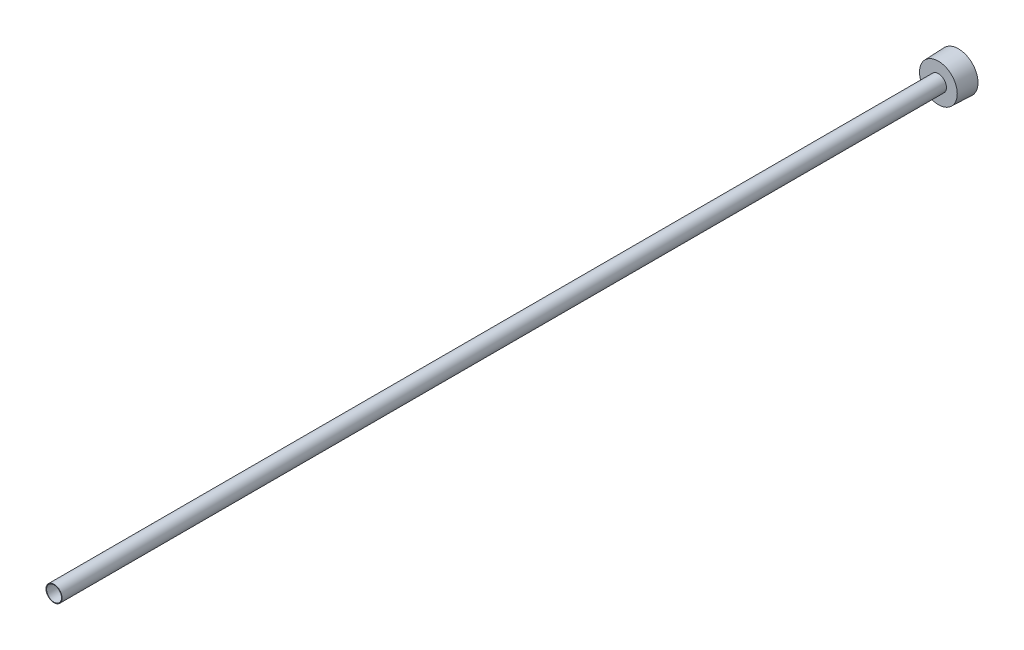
from build123d import *

# Parameters (mm, degrees)
SKETCH2_R          = 5.0419
CUT_EXTRUDE1_DEPTH = 610.886656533
CUT_EXTRUDE2_DEPTH = 9.525


with BuildPart() as part:
    # Sketch1 → Revolve1 (revolve)
    with BuildSketch(Plane(origin=(0, 0, 0), x_dir=(0, 0, -1), z_dir=(1, 0, 0)), mode=Mode.PRIVATE) as revolve1_sk:
        Polygon((-609.6, 0), (0, 0), (0, 13.2207), (-13.4874, 12.728732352), (-13.4874, 5.4229), (-609.6, 5.4229), align=None)
    revolve(revolve1_sk.sketch.rotate(Axis((0, 0, 278.001114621), (0, 0, -1)), 90), axis=Axis((0, 0, 278.001114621), (0, 0, -1)))

    # Sketch2 → Cut-Extrude1 (cut, through all)
    with BuildSketch(Plane.XY.offset(609.6)):
        Circle(SKETCH2_R)
    extrude(amount=-CUT_EXTRUDE1_DEPTH, mode=Mode.SUBTRACT)

    # Sketch3 → Cut-Extrude2 (cut)
    with BuildSketch(Plane(origin=(0, 0, 0), x_dir=(-1, 0, 0), z_dir=(0, 0, -1))):
        Polygon((0, -10.998522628), (9.525, -5.499261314), (9.525, 5.499261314), (0, 10.998522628), (-9.525, 5.499261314), (-9.525, -5.499261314), align=None)
    extrude(amount=-CUT_EXTRUDE2_DEPTH, mode=Mode.SUBTRACT)


solid = part.part
